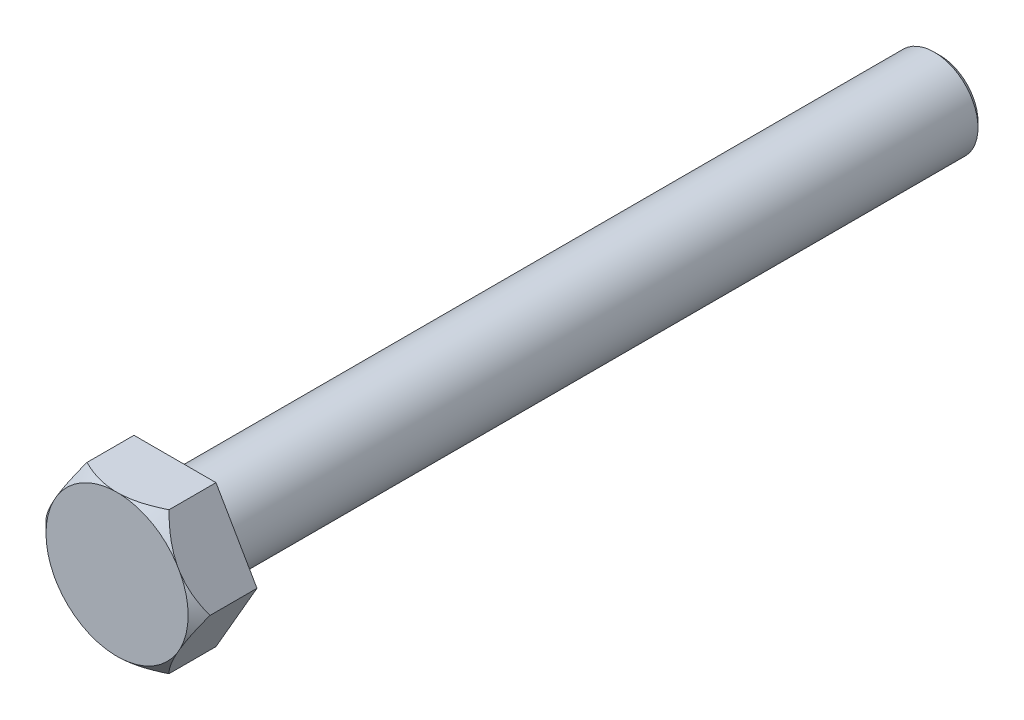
from build123d import *

# Parameters (mm, degrees)
BOSS_EXTRU_1_DEPTH = 5.3


with BuildPart() as part:
    # Esquisse1 → Boss.-Extru.1 (new body)
    with BuildSketch(Plane.XY):
        Polygon((7.505553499, 0), (3.75277675, 6.5), (-3.75277675, 6.5), (-7.505553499, 0), (-3.75277675, -6.5), (3.75277675, -6.5), align=None)
    extrude(amount=BOSS_EXTRU_1_DEPTH)

    # Esquisse3 → Enl_vement de mati_re-R_volution2 (revolve, cut)
    with BuildSketch(Plane(origin=(0, 0, 0), x_dir=(1, 0, 0), z_dir=(0, 1, 0))):
        Polygon((-7.505553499, -4.3), (-6.505553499, -5.3), (-6.505553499, -6.142860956), (-9.024896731, -6.142860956), (-9.024896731, -4.3), align=None)
    revolve(axis=Axis((0, 0, -2.903094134), (0, 0, 1)), mode=Mode.SUBTRACT)


with BuildPart() as body_2:
    # Esquisse4 → R_volution2 (revolve)
    with BuildSketch(Plane(origin=(0, 0, 0), x_dir=(0, 0, -1), z_dir=(1, 0, 0)), mode=Mode.PRIVATE) as r_volution2_sk:
        Polygon((0, -4), (69.5, -4), (70, -3.5), (70, 0), (0, 0), align=None)
    revolve(r_volution2_sk.sketch.rotate(Axis((0, 0, 0), (0, 0, -1)), 270), axis=Axis((0, 0, 0), (0, 0, -1)))


solid = Compound([part.part, body_2.part])
